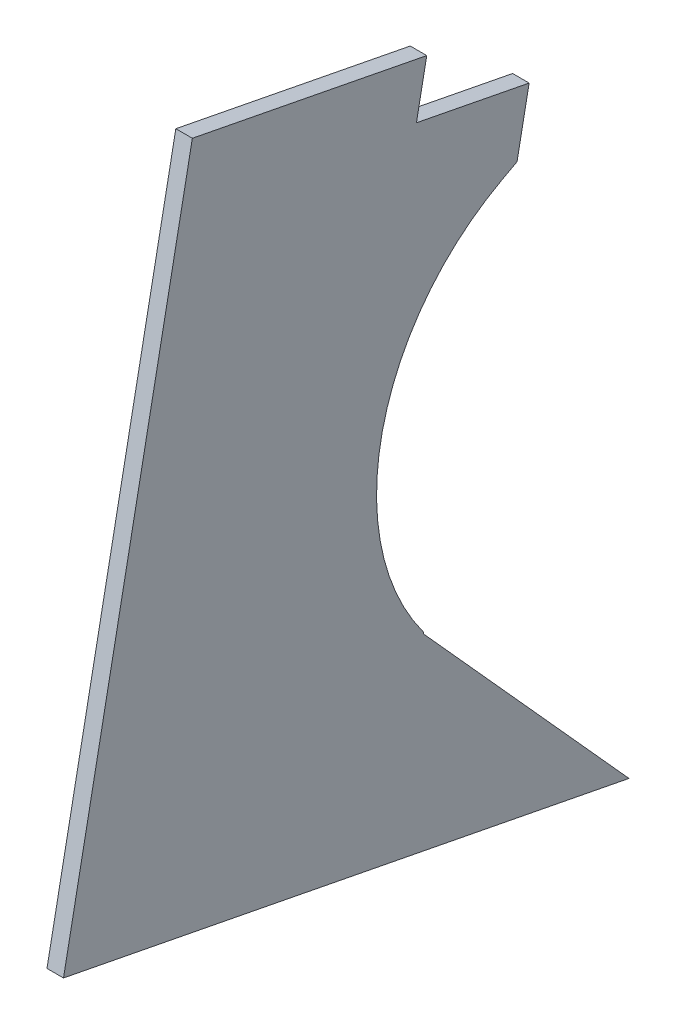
ISO-10303-21;
HEADER;
FILE_DESCRIPTION(('STEP AP214'),'2;1');
FILE_NAME('part.step','',(''),(''),'','','');
FILE_SCHEMA(('AUTOMOTIVE_DESIGN { 1 0 10303 214 1 1 1 1 }'));
ENDSEC;
DATA;
#1=APPLICATION_CONTEXT('core data for automotive mechanical design processes');
#2=APPLICATION_PROTOCOL_DEFINITION('international standard','automotive_design',2000,#1);
#3=PRODUCT_CONTEXT('',#1,'mechanical');
#4=PRODUCT('Part','Part','',(#3));
#5=PRODUCT_RELATED_PRODUCT_CATEGORY('part','',(#4));
#6=PRODUCT_DEFINITION_FORMATION('','',#4);
#7=PRODUCT_DEFINITION_CONTEXT('part definition',#1,'design');
#8=PRODUCT_DEFINITION('design','',#6,#7);
#9=PRODUCT_DEFINITION_SHAPE('','',#8);
#10=(LENGTH_UNIT() NAMED_UNIT(*) SI_UNIT(.MILLI.,.METRE.));
#11=(NAMED_UNIT(*) PLANE_ANGLE_UNIT() SI_UNIT($,.RADIAN.));
#12=(NAMED_UNIT(*) SI_UNIT($,.STERADIAN.) SOLID_ANGLE_UNIT());
#13=UNCERTAINTY_MEASURE_WITH_UNIT(LENGTH_MEASURE(1.E-05),#10,'distance_accuracy_value','');
#14=(GEOMETRIC_REPRESENTATION_CONTEXT(3) GLOBAL_UNCERTAINTY_ASSIGNED_CONTEXT((#13)) GLOBAL_UNIT_ASSIGNED_CONTEXT((#10,
#11,#12)) REPRESENTATION_CONTEXT('',''));
#15=CARTESIAN_POINT('',(0.,0.,0.));
#16=DIRECTION('',(0.,0.,1.));
#17=DIRECTION('',(1.,0.,0.));
#18=AXIS2_PLACEMENT_3D('',#15,#16,#17);
#19=CARTESIAN_POINT('',(-713.541152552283,-484.227843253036,-423.337727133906));
#20=DIRECTION('',(0.,0.190808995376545,0.981627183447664));
#21=DIRECTION('',(0.,-0.981627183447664,0.190808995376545));
#22=AXIS2_PLACEMENT_3D('',#19,#20,#21);
#23=PLANE('',#22);
#24=DIRECTION('',(1.,0.,0.));
#25=VECTOR('',#24,1.);
#26=CARTESIAN_POINT('',(-713.541152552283,-487.37384805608,-422.726205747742));
#27=LINE('',#26,#25);
#28=CARTESIAN_POINT('',(-712.398152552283,-487.37384805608,-422.726205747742));
#29=VERTEX_POINT('',#28);
#30=CARTESIAN_POINT('',(-714.684152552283,-487.37384805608,-422.726205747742));
#31=VERTEX_POINT('',#30);
#32=EDGE_CURVE('E144',#29,#31,#27,.F.);
#33=ORIENTED_EDGE('',*,*,#32,.T.);
#34=DIRECTION('',(0.,-0.981627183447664,0.190808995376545));
#35=VECTOR('',#34,1.);
#36=CARTESIAN_POINT('',(-714.684152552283,-484.227843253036,-423.337727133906));
#37=LINE('',#36,#35);
#38=CARTESIAN_POINT('',(-714.684152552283,-487.189552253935,-422.762029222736));
#39=VERTEX_POINT('',#38);
#40=EDGE_CURVE('E34',#39,#31,#37,.T.);
#41=ORIENTED_EDGE('',*,*,#40,.F.);
#42=DIRECTION('',(-1.,0.,0.));
#43=VECTOR('',#42,1.);
#44=CARTESIAN_POINT('',(-712.398152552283,-487.189552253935,-422.762029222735));
#45=LINE('',#44,#43);
#46=CARTESIAN_POINT('',(-712.398152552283,-487.189552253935,-422.762029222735));
#47=VERTEX_POINT('',#46);
#48=EDGE_CURVE('E143',#39,#47,#45,.F.);
#49=ORIENTED_EDGE('',*,*,#48,.T.);
#50=DIRECTION('',(0.,-0.981627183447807,0.190808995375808));
#51=VECTOR('',#50,1.);
#52=CARTESIAN_POINT('',(-712.398152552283,-487.189552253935,-422.762029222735));
#53=LINE('',#52,#51);
#54=EDGE_CURVE('E57',#47,#29,#53,.T.);
#55=ORIENTED_EDGE('',*,*,#54,.T.);
#56=EDGE_LOOP('',(#33,#41,#49,#55));
#57=FACE_BOUND('',#56,.T.);
#58=ADVANCED_FACE('F17',(#57),#23,.F.);
#59=CARTESIAN_POINT('',(-712.398152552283,-439.575578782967,-430.400035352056));
#60=DIRECTION('',(-1.,0.,0.));
#61=DIRECTION('',(0.,-1.,0.));
#62=AXIS2_PLACEMENT_3D('',#59,#60,#61);
#63=PLANE('',#62);
#64=CARTESIAN_POINT('',(-712.398152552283,-467.511430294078,-449.277909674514));
#65=DIRECTION('',(-1.,0.,0.));
#66=DIRECTION('',(0.,0.,1.));
#67=AXIS2_PLACEMENT_3D('',#64,#65,#66);
#68=CIRCLE('',#67,33.02);
#69=CARTESIAN_POINT('',(-712.398152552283,-438.461049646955,-433.580910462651));
#70=VERTEX_POINT('',#69);
#71=EDGE_CURVE('E20',#47,#70,#68,.T.);
#72=ORIENTED_EDGE('',*,*,#71,.T.);
#73=DIRECTION('',(0.,-0.475378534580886,0.879781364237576));
#74=VECTOR('',#73,1.);
#75=CARTESIAN_POINT('',(-712.398152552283,-379.530581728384,-542.643317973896));
#76=LINE('',#75,#74);
#77=CARTESIAN_POINT('',(-712.398152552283,-437.321529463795,-435.689816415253));
#78=VERTEX_POINT('',#77);
#79=EDGE_CURVE('E46',#70,#78,#76,.F.);
#80=ORIENTED_EDGE('',*,*,#79,.T.);
#81=DIRECTION('',(0.,-0.981627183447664,0.190808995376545));
#82=VECTOR('',#81,1.);
#83=CARTESIAN_POINT('',(-712.398152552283,-434.967000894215,-436.147490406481));
#84=LINE('',#83,#82);
#85=CARTESIAN_POINT('',(-712.398152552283,-428.733668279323,-437.359127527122));
#86=VERTEX_POINT('',#85);
#87=EDGE_CURVE('E169',#78,#86,#84,.F.);
#88=ORIENTED_EDGE('',*,*,#87,.T.);
#89=DIRECTION('',(0.,-0.190808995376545,-0.981627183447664));
#90=VECTOR('',#89,1.);
#91=CARTESIAN_POINT('',(-712.398152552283,-428.430758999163,-435.800794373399));
#92=LINE('',#91,#90);
#93=CARTESIAN_POINT('',(-712.398152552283,-425.70457547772,-421.77579598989));
#94=VERTEX_POINT('',#93);
#95=EDGE_CURVE('E167',#86,#94,#92,.F.);
#96=ORIENTED_EDGE('',*,*,#95,.T.);
#97=DIRECTION('',(0.,-0.981627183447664,0.190808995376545));
#98=VECTOR('',#97,1.);
#99=CARTESIAN_POINT('',(-712.398152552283,-472.82551465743,-412.616413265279));
#100=LINE('',#99,#98);
#101=CARTESIAN_POINT('',(-712.398152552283,-418.363997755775,-423.202659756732));
#102=VERTEX_POINT('',#101);
#103=EDGE_CURVE('E158',#94,#102,#100,.F.);
#104=ORIENTED_EDGE('',*,*,#103,.T.);
#105=DIRECTION('',(0.,-0.190808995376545,-0.981627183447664));
#106=VECTOR('',#105,1.);
#107=CARTESIAN_POINT('',(-712.398152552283,-415.213741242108,-406.995994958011));
#108=LINE('',#107,#106);
#109=CARTESIAN_POINT('',(-712.398152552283,-412.063484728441,-390.78933015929));
#110=VERTEX_POINT('',#109);
#111=EDGE_CURVE('E156',#102,#110,#108,.F.);
#112=ORIENTED_EDGE('',*,*,#111,.T.);
#113=DIRECTION('',(0.,-0.981627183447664,0.190808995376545));
#114=VECTOR('',#113,1.);
#115=CARTESIAN_POINT('',(-712.398152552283,-466.525001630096,-380.203083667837));
#116=LINE('',#115,#114);
#117=CARTESIAN_POINT('',(-712.398152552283,-503.716982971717,-372.973694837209));
#118=VERTEX_POINT('',#117);
#119=EDGE_CURVE('E148',#118,#110,#116,.F.);
#120=ORIENTED_EDGE('',*,*,#119,.F.);
#121=DIRECTION('',(0.,0.190808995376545,0.981627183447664));
#122=VECTOR('',#121,1.);
#123=CARTESIAN_POINT('',(-712.398152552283,-514.13706220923,-426.580355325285));
#124=LINE('',#123,#122);
#125=CARTESIAN_POINT('',(-712.398152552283,-518.91713676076,-451.171707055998));
#126=VERTEX_POINT('',#125);
#127=EDGE_CURVE('E109',#118,#126,#124,.F.);
#128=ORIENTED_EDGE('',*,*,#127,.T.);
#129=DIRECTION('',(0.,-0.742631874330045,-0.669699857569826));
#130=VECTOR('',#129,1.);
#131=CARTESIAN_POINT('',(-712.398152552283,-509.622543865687,-442.789912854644));
#132=LINE('',#131,#130);
#133=EDGE_CURVE('E105',#126,#29,#132,.F.);
#134=ORIENTED_EDGE('',*,*,#133,.T.);
#135=ORIENTED_EDGE('',*,*,#54,.F.);
#136=EDGE_LOOP('',(#72,#80,#88,#96,#104,#112,#120,#128,#134,#135));
#137=FACE_BOUND('',#136,.T.);
#138=ADVANCED_FACE('F199',(#137),#63,.F.);
#139=CARTESIAN_POINT('',(-824.843223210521,-379.530581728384,-542.643317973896));
#140=DIRECTION('',(0.,0.879781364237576,0.475378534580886));
#141=DIRECTION('',(0.,-0.475378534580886,0.879781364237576));
#142=AXIS2_PLACEMENT_3D('',#139,#140,#141);
#143=PLANE('',#142);
#144=DIRECTION('',(0.,0.475378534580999,-0.879781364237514));
#145=VECTOR('',#144,1.);
#146=CARTESIAN_POINT('',(-714.684152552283,-438.461049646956,-433.580910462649));
#147=LINE('',#146,#145);
#148=CARTESIAN_POINT('',(-714.684152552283,-438.461049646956,-433.580910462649));
#149=VERTEX_POINT('',#148);
#150=CARTESIAN_POINT('',(-714.684152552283,-437.321529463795,-435.689816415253));
#151=VERTEX_POINT('',#150);
#152=EDGE_CURVE('E136',#149,#151,#147,.T.);
#153=ORIENTED_EDGE('',*,*,#152,.T.);
#154=DIRECTION('',(1.,0.,0.));
#155=VECTOR('',#154,1.);
#156=CARTESIAN_POINT('',(-713.541152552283,-437.321529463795,-435.689816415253));
#157=LINE('',#156,#155);
#158=EDGE_CURVE('E174',#151,#78,#157,.T.);
#159=ORIENTED_EDGE('',*,*,#158,.T.);
#160=ORIENTED_EDGE('',*,*,#79,.F.);
#161=DIRECTION('',(-1.,0.,0.));
#162=VECTOR('',#161,1.);
#163=CARTESIAN_POINT('',(-712.398152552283,-438.461049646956,-433.580910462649));
#164=LINE('',#163,#162);
#165=EDGE_CURVE('E141',#70,#149,#164,.T.);
#166=ORIENTED_EDGE('',*,*,#165,.T.);
#167=EDGE_LOOP('',(#153,#159,#160,#166));
#168=FACE_BOUND('',#167,.T.);
#169=ADVANCED_FACE('F218',(#168),#143,.F.);
#170=CARTESIAN_POINT('',(-713.541152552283,-434.967000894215,-436.147490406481));
#171=DIRECTION('',(0.,0.190808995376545,0.981627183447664));
#172=DIRECTION('',(0.,-0.981627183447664,0.190808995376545));
#173=AXIS2_PLACEMENT_3D('',#170,#171,#172);
#174=PLANE('',#173);
#175=DIRECTION('',(1.,0.,0.));
#176=VECTOR('',#175,1.);
#177=CARTESIAN_POINT('',(-713.541152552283,-428.733668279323,-437.359127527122));
#178=LINE('',#177,#176);
#179=CARTESIAN_POINT('',(-714.684152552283,-428.733668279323,-437.359127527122));
#180=VERTEX_POINT('',#179);
#181=EDGE_CURVE('E164',#180,#86,#178,.T.);
#182=ORIENTED_EDGE('',*,*,#181,.T.);
#183=ORIENTED_EDGE('',*,*,#87,.F.);
#184=ORIENTED_EDGE('',*,*,#158,.F.);
#185=DIRECTION('',(0.,0.98162718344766,-0.190808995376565));
#186=VECTOR('',#185,1.);
#187=CARTESIAN_POINT('',(-714.684152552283,-437.321529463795,-435.689816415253));
#188=LINE('',#187,#186);
#189=EDGE_CURVE('E135',#151,#180,#188,.T.);
#190=ORIENTED_EDGE('',*,*,#189,.T.);
#191=EDGE_LOOP('',(#182,#183,#184,#190));
#192=FACE_BOUND('',#191,.T.);
#193=ADVANCED_FACE('F216',(#192),#174,.F.);
#194=CARTESIAN_POINT('',(-713.541152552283,-428.430758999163,-435.800794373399));
#195=DIRECTION('',(0.,-0.981627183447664,0.190808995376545));
#196=DIRECTION('',(0.,-0.190808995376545,-0.981627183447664));
#197=AXIS2_PLACEMENT_3D('',#194,#195,#196);
#198=PLANE('',#197);
#199=DIRECTION('',(0.,0.19080899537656,0.981627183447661));
#200=VECTOR('',#199,1.);
#201=CARTESIAN_POINT('',(-714.684152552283,-428.733668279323,-437.359127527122));
#202=LINE('',#201,#200);
#203=CARTESIAN_POINT('',(-714.684152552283,-425.70457547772,-421.77579598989));
#204=VERTEX_POINT('',#203);
#205=EDGE_CURVE('E132',#180,#204,#202,.T.);
#206=ORIENTED_EDGE('',*,*,#205,.T.);
#207=DIRECTION('',(1.,0.,0.));
#208=VECTOR('',#207,1.);
#209=CARTESIAN_POINT('',(-713.541152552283,-425.70457547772,-421.775795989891));
#210=LINE('',#209,#208);
#211=EDGE_CURVE('E161',#204,#94,#210,.T.);
#212=ORIENTED_EDGE('',*,*,#211,.T.);
#213=ORIENTED_EDGE('',*,*,#95,.F.);
#214=ORIENTED_EDGE('',*,*,#181,.F.);
#215=EDGE_LOOP('',(#206,#212,#213,#214));
#216=FACE_BOUND('',#215,.T.);
#217=ADVANCED_FACE('F213',(#216),#198,.F.);
#218=CARTESIAN_POINT('',(-713.541152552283,-472.82551465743,-412.616413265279));
#219=DIRECTION('',(0.,0.190808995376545,0.981627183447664));
#220=DIRECTION('',(0.,-0.981627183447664,0.190808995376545));
#221=AXIS2_PLACEMENT_3D('',#218,#219,#220);
#222=PLANE('',#221);
#223=DIRECTION('',(1.,0.,0.));
#224=VECTOR('',#223,1.);
#225=CARTESIAN_POINT('',(-713.541152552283,-418.363997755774,-423.202659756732));
#226=LINE('',#225,#224);
#227=CARTESIAN_POINT('',(-714.684152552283,-418.363997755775,-423.202659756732));
#228=VERTEX_POINT('',#227);
#229=EDGE_CURVE('E153',#228,#102,#226,.T.);
#230=ORIENTED_EDGE('',*,*,#229,.T.);
#231=ORIENTED_EDGE('',*,*,#103,.F.);
#232=ORIENTED_EDGE('',*,*,#211,.F.);
#233=DIRECTION('',(0.,0.981627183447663,-0.190808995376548));
#234=VECTOR('',#233,1.);
#235=CARTESIAN_POINT('',(-714.684152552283,-425.70457547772,-421.77579598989));
#236=LINE('',#235,#234);
#237=EDGE_CURVE('E129',#204,#228,#236,.T.);
#238=ORIENTED_EDGE('',*,*,#237,.T.);
#239=EDGE_LOOP('',(#230,#231,#232,#238));
#240=FACE_BOUND('',#239,.T.);
#241=ADVANCED_FACE('F209',(#240),#222,.F.);
#242=CARTESIAN_POINT('',(-713.541152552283,-415.213741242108,-406.995994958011));
#243=DIRECTION('',(0.,-0.981627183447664,0.190808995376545));
#244=DIRECTION('',(0.,-0.190808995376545,-0.981627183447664));
#245=AXIS2_PLACEMENT_3D('',#242,#243,#244);
#246=PLANE('',#245);
#247=DIRECTION('',(0.,0.190808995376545,0.981627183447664));
#248=VECTOR('',#247,1.);
#249=CARTESIAN_POINT('',(-714.684152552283,-418.363997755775,-423.202659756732));
#250=LINE('',#249,#248);
#251=CARTESIAN_POINT('',(-714.684152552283,-412.063484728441,-390.78933015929));
#252=VERTEX_POINT('',#251);
#253=EDGE_CURVE('E124',#228,#252,#250,.T.);
#254=ORIENTED_EDGE('',*,*,#253,.T.);
#255=DIRECTION('',(1.,0.,0.));
#256=VECTOR('',#255,1.);
#257=CARTESIAN_POINT('',(-713.541152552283,-412.063484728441,-390.78933015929));
#258=LINE('',#257,#256);
#259=EDGE_CURVE('E151',#110,#252,#258,.F.);
#260=ORIENTED_EDGE('',*,*,#259,.F.);
#261=ORIENTED_EDGE('',*,*,#111,.F.);
#262=ORIENTED_EDGE('',*,*,#229,.F.);
#263=EDGE_LOOP('',(#254,#260,#261,#262));
#264=FACE_BOUND('',#263,.T.);
#265=ADVANCED_FACE('F206',(#264),#246,.F.);
#266=CARTESIAN_POINT('',(-713.541152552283,-466.525001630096,-380.203083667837));
#267=DIRECTION('',(0.,0.190808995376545,0.981627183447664));
#268=DIRECTION('',(0.,-0.981627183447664,0.190808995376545));
#269=AXIS2_PLACEMENT_3D('',#266,#267,#268);
#270=PLANE('',#269);
#271=DIRECTION('',(1.,0.,0.));
#272=VECTOR('',#271,1.);
#273=CARTESIAN_POINT('',(-713.541152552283,-503.716982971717,-372.973694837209));
#274=LINE('',#273,#272);
#275=CARTESIAN_POINT('',(-714.684152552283,-503.716982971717,-372.973694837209));
#276=VERTEX_POINT('',#275);
#277=EDGE_CURVE('E121',#276,#118,#274,.T.);
#278=ORIENTED_EDGE('',*,*,#277,.T.);
#279=ORIENTED_EDGE('',*,*,#119,.T.);
#280=ORIENTED_EDGE('',*,*,#259,.T.);
#281=DIRECTION('',(0.,-0.981627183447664,0.190808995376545));
#282=VECTOR('',#281,1.);
#283=CARTESIAN_POINT('',(-714.684152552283,-412.063484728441,-390.78933015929));
#284=LINE('',#283,#282);
#285=EDGE_CURVE('E122',#252,#276,#284,.T.);
#286=ORIENTED_EDGE('',*,*,#285,.T.);
#287=EDGE_LOOP('',(#278,#279,#280,#286));
#288=FACE_BOUND('',#287,.T.);
#289=ADVANCED_FACE('F201',(#288),#270,.T.);
#290=CARTESIAN_POINT('',(-713.541152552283,-514.13706220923,-426.580355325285));
#291=DIRECTION('',(0.,0.981627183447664,-0.190808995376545));
#292=DIRECTION('',(0.,0.190808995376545,0.981627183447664));
#293=AXIS2_PLACEMENT_3D('',#290,#291,#292);
#294=PLANE('',#293);
#295=ORIENTED_EDGE('',*,*,#277,.F.);
#296=DIRECTION('',(0.,-0.190808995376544,-0.981627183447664));
#297=VECTOR('',#296,1.);
#298=CARTESIAN_POINT('',(-714.684152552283,-503.716982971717,-372.973694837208));
#299=LINE('',#298,#297);
#300=CARTESIAN_POINT('',(-714.684152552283,-518.91713676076,-451.171707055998));
#301=VERTEX_POINT('',#300);
#302=EDGE_CURVE('E116',#276,#301,#299,.T.);
#303=ORIENTED_EDGE('',*,*,#302,.T.);
#304=DIRECTION('',(1.,0.,0.));
#305=VECTOR('',#304,1.);
#306=CARTESIAN_POINT('',(-713.541152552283,-518.91713676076,-451.171707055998));
#307=LINE('',#306,#305);
#308=EDGE_CURVE('E101',#301,#126,#307,.T.);
#309=ORIENTED_EDGE('',*,*,#308,.T.);
#310=ORIENTED_EDGE('',*,*,#127,.F.);
#311=EDGE_LOOP('',(#295,#303,#309,#310));
#312=FACE_BOUND('',#311,.T.);
#313=ADVANCED_FACE('F119',(#312),#294,.F.);
#314=CARTESIAN_POINT('',(-713.541152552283,-509.622543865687,-442.789912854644));
#315=DIRECTION('',(0.,-0.669699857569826,0.742631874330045));
#316=DIRECTION('',(0.,-0.742631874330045,-0.669699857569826));
#317=AXIS2_PLACEMENT_3D('',#314,#315,#316);
#318=PLANE('',#317);
#319=ORIENTED_EDGE('',*,*,#133,.F.);
#320=ORIENTED_EDGE('',*,*,#308,.F.);
#321=DIRECTION('',(0.,0.742631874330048,0.669699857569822));
#322=VECTOR('',#321,1.);
#323=CARTESIAN_POINT('',(-714.684152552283,-518.91713676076,-451.171707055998));
#324=LINE('',#323,#322);
#325=EDGE_CURVE('E26',#301,#31,#324,.T.);
#326=ORIENTED_EDGE('',*,*,#325,.T.);
#327=ORIENTED_EDGE('',*,*,#32,.F.);
#328=EDGE_LOOP('',(#319,#320,#326,#327));
#329=FACE_BOUND('',#328,.T.);
#330=ADVANCED_FACE('F103',(#329),#318,.F.);
#331=CARTESIAN_POINT('',(-712.398152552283,-467.511430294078,-449.277909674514));
#332=DIRECTION('',(-1.,0.,0.));
#333=DIRECTION('',(0.,0.,1.));
#334=AXIS2_PLACEMENT_3D('',#331,#332,#333);
#335=CYLINDRICAL_SURFACE('',#334,33.02);
#336=ORIENTED_EDGE('',*,*,#71,.F.);
#337=ORIENTED_EDGE('',*,*,#48,.F.);
#338=CARTESIAN_POINT('',(-714.684152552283,-467.511430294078,-449.277909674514));
#339=DIRECTION('',(-1.,0.,0.));
#340=DIRECTION('',(0.,0.,1.));
#341=AXIS2_PLACEMENT_3D('',#338,#339,#340);
#342=CIRCLE('',#341,33.02);
#343=EDGE_CURVE('E11',#39,#149,#342,.T.);
#344=ORIENTED_EDGE('',*,*,#343,.T.);
#345=ORIENTED_EDGE('',*,*,#165,.F.);
#346=EDGE_LOOP('',(#336,#337,#344,#345));
#347=FACE_BOUND('',#346,.T.);
#348=ADVANCED_FACE('F219',(#347),#335,.F.);
#349=CARTESIAN_POINT('',(-714.684152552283,-439.575578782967,-430.400035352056));
#350=DIRECTION('',(1.,0.,0.));
#351=DIRECTION('',(0.,1.,0.));
#352=AXIS2_PLACEMENT_3D('',#349,#350,#351);
#353=PLANE('',#352);
#354=ORIENTED_EDGE('',*,*,#343,.F.);
#355=ORIENTED_EDGE('',*,*,#40,.T.);
#356=ORIENTED_EDGE('',*,*,#325,.F.);
#357=ORIENTED_EDGE('',*,*,#302,.F.);
#358=ORIENTED_EDGE('',*,*,#285,.F.);
#359=ORIENTED_EDGE('',*,*,#253,.F.);
#360=ORIENTED_EDGE('',*,*,#237,.F.);
#361=ORIENTED_EDGE('',*,*,#205,.F.);
#362=ORIENTED_EDGE('',*,*,#189,.F.);
#363=ORIENTED_EDGE('',*,*,#152,.F.);
#364=EDGE_LOOP('',(#354,#355,#356,#357,#358,#359,#360,#361,#362,#363));
#365=FACE_BOUND('',#364,.T.);
#366=ADVANCED_FACE('F114',(#365),#353,.F.);
#367=CLOSED_SHELL('',(#58,#138,#169,#193,#217,#241,#265,#289,#313,#330,#348,#366));
#368=MANIFOLD_SOLID_BREP('B1',#367);
#369=ADVANCED_BREP_SHAPE_REPRESENTATION('',(#18,#368),#14);
#370=SHAPE_DEFINITION_REPRESENTATION(#9,#369);
ENDSEC;
END-ISO-10303-21;
